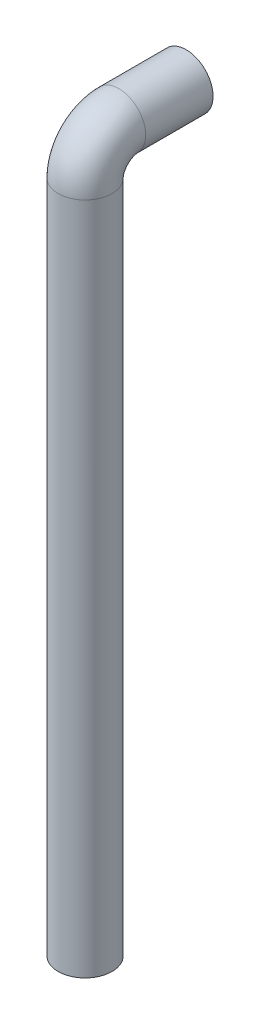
ISO-10303-21;
HEADER;
FILE_DESCRIPTION(('STEP AP214'),'2;1');
FILE_NAME('part.step','',(''),(''),'','','');
FILE_SCHEMA(('AUTOMOTIVE_DESIGN { 1 0 10303 214 1 1 1 1 }'));
ENDSEC;
DATA;
#1=APPLICATION_CONTEXT('core data for automotive mechanical design processes');
#2=APPLICATION_PROTOCOL_DEFINITION('international standard','automotive_design',2000,#1);
#3=PRODUCT_CONTEXT('',#1,'mechanical');
#4=PRODUCT('Part','Part','',(#3));
#5=PRODUCT_RELATED_PRODUCT_CATEGORY('part','',(#4));
#6=PRODUCT_DEFINITION_FORMATION('','',#4);
#7=PRODUCT_DEFINITION_CONTEXT('part definition',#1,'design');
#8=PRODUCT_DEFINITION('design','',#6,#7);
#9=PRODUCT_DEFINITION_SHAPE('','',#8);
#10=(LENGTH_UNIT() NAMED_UNIT(*) SI_UNIT(.MILLI.,.METRE.));
#11=(NAMED_UNIT(*) PLANE_ANGLE_UNIT() SI_UNIT($,.RADIAN.));
#12=(NAMED_UNIT(*) SI_UNIT($,.STERADIAN.) SOLID_ANGLE_UNIT());
#13=UNCERTAINTY_MEASURE_WITH_UNIT(LENGTH_MEASURE(1.E-05),#10,'distance_accuracy_value','');
#14=(GEOMETRIC_REPRESENTATION_CONTEXT(3) GLOBAL_UNCERTAINTY_ASSIGNED_CONTEXT((#13)) GLOBAL_UNIT_ASSIGNED_CONTEXT((#10,
#11,#12)) REPRESENTATION_CONTEXT('',''));
#15=CARTESIAN_POINT('',(0.,0.,0.));
#16=DIRECTION('',(0.,0.,1.));
#17=DIRECTION('',(1.,0.,0.));
#18=AXIS2_PLACEMENT_3D('',#15,#16,#17);
#19=CARTESIAN_POINT('',(-33.3087189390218,10.5,-4.0881473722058));
#20=DIRECTION('',(0.,0.,-1.));
#21=DIRECTION('',(-1.,0.,0.));
#22=AXIS2_PLACEMENT_3D('',#19,#20,#21);
#23=PLANE('',#22);
#24=CARTESIAN_POINT('',(-33.3087189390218,10.5,-4.0881473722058));
#25=DIRECTION('',(0.,0.,-1.));
#26=DIRECTION('',(-1.,0.,0.));
#27=AXIS2_PLACEMENT_3D('',#24,#25,#26);
#28=CIRCLE('',#27,0.399999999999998);
#29=CARTESIAN_POINT('',(-33.7087189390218,10.5,-4.0881473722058));
#30=VERTEX_POINT('',#29);
#31=EDGE_CURVE('E18',#30,#30,#28,.F.);
#32=ORIENTED_EDGE('',*,*,#31,.F.);
#33=EDGE_LOOP('',(#32));
#34=FACE_BOUND('',#33,.T.);
#35=ADVANCED_FACE('F15',(#34),#23,.T.);
#36=CARTESIAN_POINT('',(-33.3087189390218,10.5,-3.0881473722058));
#37=DIRECTION('',(0.,0.,-1.));
#38=DIRECTION('',(-1.,0.,0.));
#39=AXIS2_PLACEMENT_3D('',#36,#37,#38);
#40=CYLINDRICAL_SURFACE('',#39,0.399999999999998);
#41=ORIENTED_EDGE('',*,*,#31,.T.);
#42=EDGE_LOOP('',(#41));
#43=FACE_BOUND('',#42,.T.);
#44=CARTESIAN_POINT('',(-33.3087189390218,10.5,-3.0881473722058));
#45=DIRECTION('',(0.,0.,-1.));
#46=DIRECTION('',(0.,1.,0.));
#47=AXIS2_PLACEMENT_3D('',#44,#45,#46);
#48=CIRCLE('',#47,0.399999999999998);
#49=CARTESIAN_POINT('',(-33.3087189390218,10.9,-3.0881473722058));
#50=VERTEX_POINT('',#49);
#51=EDGE_CURVE('E26',#50,#50,#48,.F.);
#52=ORIENTED_EDGE('',*,*,#51,.F.);
#53=EDGE_LOOP('',(#52));
#54=FACE_BOUND('',#53,.T.);
#55=ADVANCED_FACE('F37',(#43,#54),#40,.T.);
#56=CARTESIAN_POINT('',(-33.3087189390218,10.,-3.0881473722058));
#57=DIRECTION('',(-1.,0.,0.));
#58=DIRECTION('',(0.,0.,1.));
#59=AXIS2_PLACEMENT_3D('',#56,#57,#58);
#60=TOROIDAL_SURFACE('',#59,0.5,0.399999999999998);
#61=CARTESIAN_POINT('',(-33.3087189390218,10.,-2.5881473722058));
#62=DIRECTION('',(0.,-1.,0.));
#63=DIRECTION('',(0.,0.,-1.));
#64=AXIS2_PLACEMENT_3D('',#61,#62,#63);
#65=CIRCLE('',#64,0.399999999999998);
#66=CARTESIAN_POINT('',(-33.3087189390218,10.,-2.9881473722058));
#67=VERTEX_POINT('',#66);
#68=EDGE_CURVE('E22',#67,#67,#65,.T.);
#69=ORIENTED_EDGE('',*,*,#68,.F.);
#70=EDGE_LOOP('',(#69));
#71=FACE_BOUND('',#70,.T.);
#72=ORIENTED_EDGE('',*,*,#51,.T.);
#73=EDGE_LOOP('',(#72));
#74=FACE_BOUND('',#73,.T.);
#75=ADVANCED_FACE('F33',(#71,#74),#60,.T.);
#76=CARTESIAN_POINT('',(-33.3087189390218,0.,-2.5881473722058));
#77=DIRECTION('',(0.,1.,0.));
#78=DIRECTION('',(0.,0.,1.));
#79=AXIS2_PLACEMENT_3D('',#76,#77,#78);
#80=PLANE('',#79);
#81=CARTESIAN_POINT('',(-33.3087189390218,0.,-2.5881473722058));
#82=DIRECTION('',(0.,-1.,0.));
#83=DIRECTION('',(0.,0.,-1.));
#84=AXIS2_PLACEMENT_3D('',#81,#82,#83);
#85=CIRCLE('',#84,0.399999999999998);
#86=CARTESIAN_POINT('',(-33.3087189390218,0.,-2.9881473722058));
#87=VERTEX_POINT('',#86);
#88=EDGE_CURVE('E10',#87,#87,#85,.F.);
#89=ORIENTED_EDGE('',*,*,#88,.F.);
#90=EDGE_LOOP('',(#89));
#91=FACE_BOUND('',#90,.T.);
#92=ADVANCED_FACE('F36',(#91),#80,.F.);
#93=CARTESIAN_POINT('',(-33.3087189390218,10.,-2.5881473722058));
#94=DIRECTION('',(0.,-1.,0.));
#95=DIRECTION('',(0.,0.,-1.));
#96=AXIS2_PLACEMENT_3D('',#93,#94,#95);
#97=CYLINDRICAL_SURFACE('',#96,0.399999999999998);
#98=ORIENTED_EDGE('',*,*,#88,.T.);
#99=EDGE_LOOP('',(#98));
#100=FACE_BOUND('',#99,.T.);
#101=ORIENTED_EDGE('',*,*,#68,.T.);
#102=EDGE_LOOP('',(#101));
#103=FACE_BOUND('',#102,.T.);
#104=ADVANCED_FACE('F49',(#100,#103),#97,.T.);
#105=CLOSED_SHELL('',(#35,#55,#75,#92,#104));
#106=MANIFOLD_SOLID_BREP('B1',#105);
#107=ADVANCED_BREP_SHAPE_REPRESENTATION('',(#18,#106),#14);
#108=SHAPE_DEFINITION_REPRESENTATION(#9,#107);
ENDSEC;
END-ISO-10303-21;
